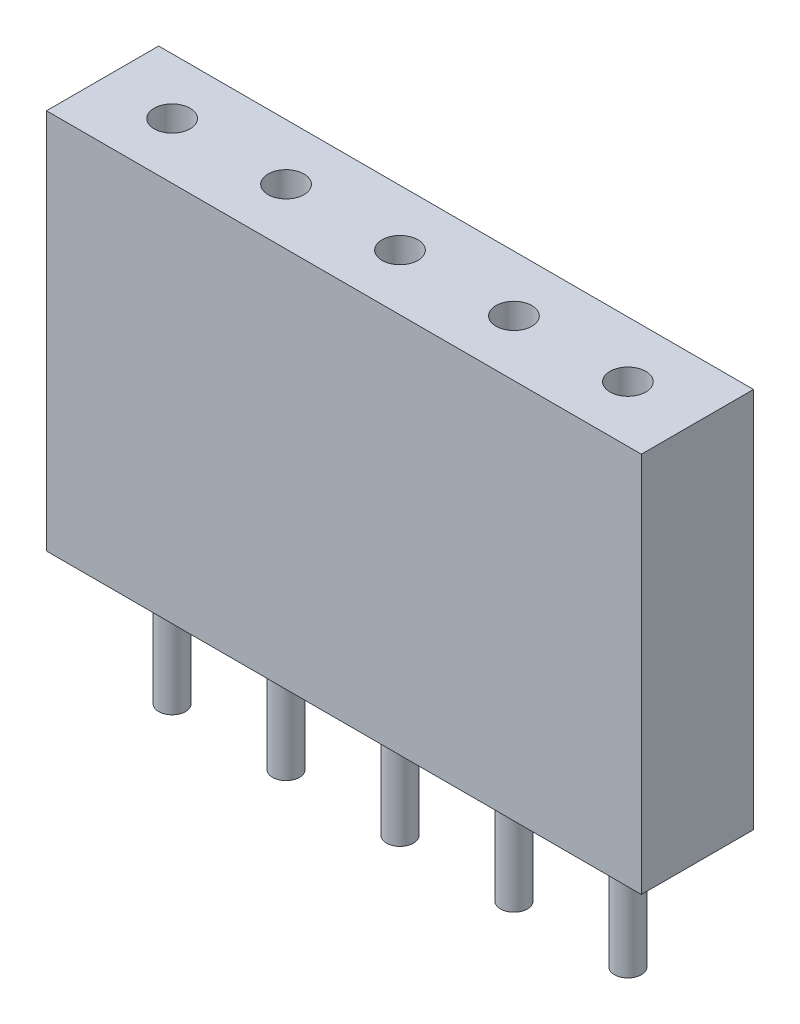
from build123d import *

# Parameters (mm, degrees)
ESQUISSE1_W             = 13.26
ESQUISSE1_H             = 8.5
BOSS_EXTRU_1_DEPTH      = 2.5
ESQUISSE2_R             = 0.3
BOSS_EXTRU_2_DEPTH      = 2.8
ESQUISSE3_R             = 0.4
ENL_V_MAT_EXTRU_1_DEPTH = 7


with BuildPart() as part:
    # Esquisse1 → Boss.-Extru.1 (new body)
    with BuildSketch(Plane.XY):
        with Locations((6.63, 4.25)):
            Rectangle(ESQUISSE1_W, ESQUISSE1_H)
    extrude(amount=BOSS_EXTRU_1_DEPTH)

    # Esquisse2 → Boss.-Extru.2 (add)
    with BuildSketch(Plane.XZ):
        with Locations(Location((6.63, 1.25, 0), (0, 0, 90))):
            Circle(ESQUISSE2_R)
        with Locations(Location((9.17, 1.25, 0), (0, 0, 90))):
            Circle(ESQUISSE2_R)
        with Locations(Location((11.71, 1.25, 0), (0, 0, 90))):
            Circle(ESQUISSE2_R)
        with Locations(Location((4.09, 1.25, 0), (0, 0, 90))):
            Circle(ESQUISSE2_R)
        with Locations(Location((1.55, 1.25, 0), (0, 0, 90))):
            Circle(ESQUISSE2_R)
    extrude(amount=BOSS_EXTRU_2_DEPTH)

    # Esquisse3 → Enl_v. mat.-Extru.1 (cut)
    with BuildSketch(Plane(origin=(0, 8.5, 0), x_dir=(1, 0, 0), z_dir=(0, 1, 0))):
        with Locations(Location((6.63, -1.25, 0), (0, 0, 270))):
            Circle(ESQUISSE3_R)
        with Locations(Location((9.17, -1.25, 0), (0, 0, 270))):
            Circle(ESQUISSE3_R)
        with Locations(Location((11.71, -1.25, 0), (0, 0, 270))):
            Circle(ESQUISSE3_R)
        with Locations(Location((4.09, -1.25, 0), (0, 0, 270))):
            Circle(ESQUISSE3_R)
        with Locations(Location((1.55, -1.25, 0), (0, 0, 270))):
            Circle(ESQUISSE3_R)
    extrude(amount=-ENL_V_MAT_EXTRU_1_DEPTH, mode=Mode.SUBTRACT)


solid = part.part
